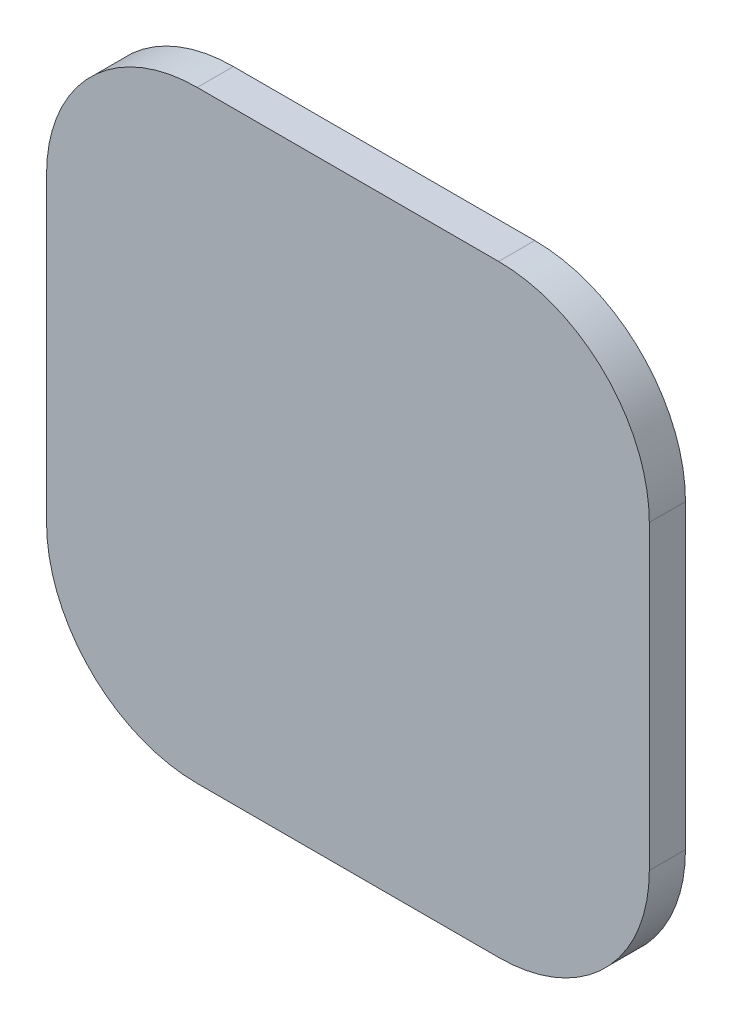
ISO-10303-21;
HEADER;
FILE_DESCRIPTION(('STEP AP214'),'2;1');
FILE_NAME('part.step','',(''),(''),'','','');
FILE_SCHEMA(('AUTOMOTIVE_DESIGN { 1 0 10303 214 1 1 1 1 }'));
ENDSEC;
DATA;
#1=APPLICATION_CONTEXT('core data for automotive mechanical design processes');
#2=APPLICATION_PROTOCOL_DEFINITION('international standard','automotive_design',2000,#1);
#3=PRODUCT_CONTEXT('',#1,'mechanical');
#4=PRODUCT('Part','Part','',(#3));
#5=PRODUCT_RELATED_PRODUCT_CATEGORY('part','',(#4));
#6=PRODUCT_DEFINITION_FORMATION('','',#4);
#7=PRODUCT_DEFINITION_CONTEXT('part definition',#1,'design');
#8=PRODUCT_DEFINITION('design','',#6,#7);
#9=PRODUCT_DEFINITION_SHAPE('','',#8);
#10=(LENGTH_UNIT() NAMED_UNIT(*) SI_UNIT(.MILLI.,.METRE.));
#11=(NAMED_UNIT(*) PLANE_ANGLE_UNIT() SI_UNIT($,.RADIAN.));
#12=(NAMED_UNIT(*) SI_UNIT($,.STERADIAN.) SOLID_ANGLE_UNIT());
#13=UNCERTAINTY_MEASURE_WITH_UNIT(LENGTH_MEASURE(1.E-05),#10,'distance_accuracy_value','');
#14=(GEOMETRIC_REPRESENTATION_CONTEXT(3) GLOBAL_UNCERTAINTY_ASSIGNED_CONTEXT((#13)) GLOBAL_UNIT_ASSIGNED_CONTEXT((#10,
#11,#12)) REPRESENTATION_CONTEXT('',''));
#15=CARTESIAN_POINT('',(0.,0.,0.));
#16=DIRECTION('',(0.,0.,1.));
#17=DIRECTION('',(1.,0.,0.));
#18=AXIS2_PLACEMENT_3D('',#15,#16,#17);
#19=CARTESIAN_POINT('',(-0.635,-0.635,0.));
#20=DIRECTION('',(0.,0.,1.));
#21=DIRECTION('',(1.,0.,0.));
#22=AXIS2_PLACEMENT_3D('',#19,#20,#21);
#23=PLANE('',#22);
#24=CARTESIAN_POINT('',(0.3175,-0.3175,0.));
#25=DIRECTION('',(0.,0.,1.));
#26=DIRECTION('',(1.,0.,0.));
#27=AXIS2_PLACEMENT_3D('',#24,#25,#26);
#28=CIRCLE('',#27,0.3175);
#29=CARTESIAN_POINT('',(0.31749975,-0.635,0.));
#30=VERTEX_POINT('',#29);
#31=CARTESIAN_POINT('',(0.635,-0.31749975,0.));
#32=VERTEX_POINT('',#31);
#33=EDGE_CURVE('E149',#30,#32,#28,.T.);
#34=ORIENTED_EDGE('',*,*,#33,.F.);
#35=CARTESIAN_POINT('',(-0.3175,-0.635,0.));
#36=CARTESIAN_POINT('',(0.3175,-0.635,0.));
#37=B_SPLINE_CURVE_WITH_KNOTS('',1,(#35,#36),.UNSPECIFIED.,.F.,.F.,(2,2),(0.,1.),.UNSPECIFIED.);
#38=CARTESIAN_POINT('',(-0.31749975,-0.635,0.));
#39=VERTEX_POINT('',#38);
#40=EDGE_CURVE('E107',#39,#30,#37,.T.);
#41=ORIENTED_EDGE('',*,*,#40,.F.);
#42=CARTESIAN_POINT('',(-0.3175,-0.3175,0.));
#43=DIRECTION('',(0.,0.,1.));
#44=DIRECTION('',(1.,0.,0.));
#45=AXIS2_PLACEMENT_3D('',#42,#43,#44);
#46=CIRCLE('',#45,0.3175);
#47=CARTESIAN_POINT('',(-0.635,-0.31749975,0.));
#48=VERTEX_POINT('',#47);
#49=EDGE_CURVE('E151',#48,#39,#46,.T.);
#50=ORIENTED_EDGE('',*,*,#49,.F.);
#51=CARTESIAN_POINT('',(-0.635,0.3175,0.));
#52=CARTESIAN_POINT('',(-0.635,-0.3175,0.));
#53=B_SPLINE_CURVE_WITH_KNOTS('',1,(#51,#52),.UNSPECIFIED.,.F.,.F.,(2,2),(0.,1.),.UNSPECIFIED.);
#54=CARTESIAN_POINT('',(-0.635,0.31749975,0.));
#55=VERTEX_POINT('',#54);
#56=EDGE_CURVE('E117',#55,#48,#53,.T.);
#57=ORIENTED_EDGE('',*,*,#56,.F.);
#58=CARTESIAN_POINT('',(-0.3175,0.3175,0.));
#59=DIRECTION('',(0.,0.,1.));
#60=DIRECTION('',(1.,0.,0.));
#61=AXIS2_PLACEMENT_3D('',#58,#59,#60);
#62=CIRCLE('',#61,0.3175);
#63=CARTESIAN_POINT('',(-0.31749975,0.635,0.));
#64=VERTEX_POINT('',#63);
#65=EDGE_CURVE('E153',#64,#55,#62,.T.);
#66=ORIENTED_EDGE('',*,*,#65,.F.);
#67=CARTESIAN_POINT('',(0.3175,0.635,0.));
#68=CARTESIAN_POINT('',(-0.3175,0.635,0.));
#69=B_SPLINE_CURVE_WITH_KNOTS('',1,(#67,#68),.UNSPECIFIED.,.F.,.F.,(2,2),(0.,1.),.UNSPECIFIED.);
#70=CARTESIAN_POINT('',(0.31749975,0.635,0.));
#71=VERTEX_POINT('',#70);
#72=EDGE_CURVE('E85',#71,#64,#69,.T.);
#73=ORIENTED_EDGE('',*,*,#72,.F.);
#74=CARTESIAN_POINT('',(0.3175,0.3175,0.));
#75=DIRECTION('',(0.,0.,1.));
#76=DIRECTION('',(1.,0.,0.));
#77=AXIS2_PLACEMENT_3D('',#74,#75,#76);
#78=CIRCLE('',#77,0.3175);
#79=CARTESIAN_POINT('',(0.635,0.3175,2.49999999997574E-07));
#80=VERTEX_POINT('',#79);
#81=EDGE_CURVE('E21',#80,#71,#78,.T.);
#82=ORIENTED_EDGE('',*,*,#81,.F.);
#83=CARTESIAN_POINT('',(0.635,-0.3175,0.));
#84=CARTESIAN_POINT('',(0.635,0.3175,0.));
#85=B_SPLINE_CURVE_WITH_KNOTS('',1,(#83,#84),.UNSPECIFIED.,.F.,.F.,(2,2),(0.,1.),.UNSPECIFIED.);
#86=EDGE_CURVE('E83',#32,#80,#85,.T.);
#87=ORIENTED_EDGE('',*,*,#86,.F.);
#88=EDGE_LOOP('',(#34,#41,#50,#57,#66,#73,#82,#87));
#89=FACE_BOUND('',#88,.T.);
#90=ADVANCED_FACE('F17',(#89),#23,.F.);
#91=CARTESIAN_POINT('',(0.635,0.3175,0.0762));
#92=CARTESIAN_POINT('',(0.635,0.3175,0.));
#93=B_SPLINE_CURVE_WITH_KNOTS('',1,(#91,#92),.UNSPECIFIED.,.F.,.F.,(2,2),(0.,1.),.UNSPECIFIED.);
#94=CARTESIAN_POINT('',(0.3175,0.3175,0.));
#95=DIRECTION('',(0.,0.,1.));
#96=AXIS1_PLACEMENT('',#94,#95);
#97=SURFACE_OF_REVOLUTION('',#93,#96);
#98=CARTESIAN_POINT('',(0.635,0.3175,0.0762));
#99=CARTESIAN_POINT('',(0.635,0.3175,0.));
#100=B_SPLINE_CURVE_WITH_KNOTS('',1,(#98,#99),.UNSPECIFIED.,.F.,.F.,(2,2),(0.,1.),.UNSPECIFIED.);
#101=CARTESIAN_POINT('',(0.635,0.3175,0.0762));
#102=VERTEX_POINT('',#101);
#103=EDGE_CURVE('E89',#80,#102,#100,.F.);
#104=ORIENTED_EDGE('',*,*,#103,.F.);
#105=ORIENTED_EDGE('',*,*,#81,.T.);
#106=CARTESIAN_POINT('',(0.3175,0.635,0.0762));
#107=CARTESIAN_POINT('',(0.3175,0.635,0.));
#108=B_SPLINE_CURVE_WITH_KNOTS('',1,(#106,#107),.UNSPECIFIED.,.F.,.F.,(2,2),(0.,1.),.UNSPECIFIED.);
#109=CARTESIAN_POINT('',(0.3175,0.635,0.0762));
#110=VERTEX_POINT('',#109);
#111=EDGE_CURVE('E133',#110,#71,#108,.T.);
#112=ORIENTED_EDGE('',*,*,#111,.F.);
#113=CARTESIAN_POINT('',(0.3175,0.3175,0.0762));
#114=DIRECTION('',(0.,0.,1.));
#115=DIRECTION('',(1.,0.,0.));
#116=AXIS2_PLACEMENT_3D('',#113,#114,#115);
#117=CIRCLE('',#116,0.3175);
#118=EDGE_CURVE('E92',#102,#110,#117,.T.);
#119=ORIENTED_EDGE('',*,*,#118,.F.);
#120=EDGE_LOOP('',(#104,#105,#112,#119));
#121=FACE_BOUND('',#120,.T.);
#122=ADVANCED_FACE('F90',(#121),#97,.F.);
#123=CARTESIAN_POINT('',(0.3175,0.635,0.0762));
#124=DIRECTION('',(0.,1.,0.));
#125=DIRECTION('',(0.,0.,-1.));
#126=AXIS2_PLACEMENT_3D('',#123,#124,#125);
#127=PLANE('',#126);
#128=ORIENTED_EDGE('',*,*,#111,.T.);
#129=ORIENTED_EDGE('',*,*,#72,.T.);
#130=CARTESIAN_POINT('',(-0.3175,0.635,0.0762));
#131=CARTESIAN_POINT('',(-0.3175,0.635,0.));
#132=B_SPLINE_CURVE_WITH_KNOTS('',1,(#130,#131),.UNSPECIFIED.,.F.,.F.,(2,2),(0.,1.),.UNSPECIFIED.);
#133=CARTESIAN_POINT('',(-0.3175,0.635,0.0762));
#134=VERTEX_POINT('',#133);
#135=EDGE_CURVE('E126',#134,#64,#132,.T.);
#136=ORIENTED_EDGE('',*,*,#135,.F.);
#137=DIRECTION('',(-1.,0.,0.));
#138=VECTOR('',#137,1.);
#139=CARTESIAN_POINT('',(0.,0.635,0.0762));
#140=LINE('',#139,#138);
#141=EDGE_CURVE('E147',#110,#134,#140,.T.);
#142=ORIENTED_EDGE('',*,*,#141,.F.);
#143=EDGE_LOOP('',(#128,#129,#136,#142));
#144=FACE_BOUND('',#143,.T.);
#145=ADVANCED_FACE('F188',(#144),#127,.T.);
#146=CARTESIAN_POINT('',(-0.3175,0.635,0.0762));
#147=CARTESIAN_POINT('',(-0.3175,0.635,0.));
#148=B_SPLINE_CURVE_WITH_KNOTS('',1,(#146,#147),.UNSPECIFIED.,.F.,.F.,(2,2),(0.,1.),.UNSPECIFIED.);
#149=CARTESIAN_POINT('',(-0.3175,0.3175,0.));
#150=DIRECTION('',(0.,0.,1.));
#151=AXIS1_PLACEMENT('',#149,#150);
#152=SURFACE_OF_REVOLUTION('',#148,#151);
#153=ORIENTED_EDGE('',*,*,#135,.T.);
#154=ORIENTED_EDGE('',*,*,#65,.T.);
#155=CARTESIAN_POINT('',(-0.635,0.3175,0.0762));
#156=CARTESIAN_POINT('',(-0.635,0.3175,0.));
#157=B_SPLINE_CURVE_WITH_KNOTS('',1,(#155,#156),.UNSPECIFIED.,.F.,.F.,(2,2),(0.,1.),.UNSPECIFIED.);
#158=CARTESIAN_POINT('',(-0.635,0.3175,0.0762));
#159=VERTEX_POINT('',#158);
#160=EDGE_CURVE('E125',#159,#55,#157,.T.);
#161=ORIENTED_EDGE('',*,*,#160,.F.);
#162=CARTESIAN_POINT('',(-0.3175,0.3175,0.0762));
#163=DIRECTION('',(0.,0.,1.));
#164=DIRECTION('',(1.,0.,0.));
#165=AXIS2_PLACEMENT_3D('',#162,#163,#164);
#166=CIRCLE('',#165,0.3175);
#167=EDGE_CURVE('E144',#134,#159,#166,.T.);
#168=ORIENTED_EDGE('',*,*,#167,.F.);
#169=EDGE_LOOP('',(#153,#154,#161,#168));
#170=FACE_BOUND('',#169,.T.);
#171=ADVANCED_FACE('F183',(#170),#152,.F.);
#172=CARTESIAN_POINT('',(-0.635,0.3175,0.0762));
#173=DIRECTION('',(-1.,0.,0.));
#174=DIRECTION('',(0.,0.,-1.));
#175=AXIS2_PLACEMENT_3D('',#172,#173,#174);
#176=PLANE('',#175);
#177=ORIENTED_EDGE('',*,*,#160,.T.);
#178=ORIENTED_EDGE('',*,*,#56,.T.);
#179=CARTESIAN_POINT('',(-0.635,-0.3175,0.0762));
#180=CARTESIAN_POINT('',(-0.635,-0.3175,0.));
#181=B_SPLINE_CURVE_WITH_KNOTS('',1,(#179,#180),.UNSPECIFIED.,.F.,.F.,(2,2),(0.,1.),.UNSPECIFIED.);
#182=CARTESIAN_POINT('',(-0.635,-0.3175,0.0762));
#183=VERTEX_POINT('',#182);
#184=EDGE_CURVE('E116',#183,#48,#181,.T.);
#185=ORIENTED_EDGE('',*,*,#184,.F.);
#186=DIRECTION('',(0.,-1.,0.));
#187=VECTOR('',#186,1.);
#188=CARTESIAN_POINT('',(-0.635,0.,0.0762));
#189=LINE('',#188,#187);
#190=EDGE_CURVE('E143',#159,#183,#189,.T.);
#191=ORIENTED_EDGE('',*,*,#190,.F.);
#192=EDGE_LOOP('',(#177,#178,#185,#191));
#193=FACE_BOUND('',#192,.T.);
#194=ADVANCED_FACE('F187',(#193),#176,.T.);
#195=CARTESIAN_POINT('',(-0.635,-0.3175,0.0762));
#196=CARTESIAN_POINT('',(-0.635,-0.3175,0.));
#197=B_SPLINE_CURVE_WITH_KNOTS('',1,(#195,#196),.UNSPECIFIED.,.F.,.F.,(2,2),(0.,1.),.UNSPECIFIED.);
#198=CARTESIAN_POINT('',(-0.3175,-0.3175,0.));
#199=DIRECTION('',(0.,0.,1.));
#200=AXIS1_PLACEMENT('',#198,#199);
#201=SURFACE_OF_REVOLUTION('',#197,#200);
#202=ORIENTED_EDGE('',*,*,#184,.T.);
#203=ORIENTED_EDGE('',*,*,#49,.T.);
#204=CARTESIAN_POINT('',(-0.3175,-0.635,0.0762));
#205=CARTESIAN_POINT('',(-0.3175,-0.635,0.));
#206=B_SPLINE_CURVE_WITH_KNOTS('',1,(#204,#205),.UNSPECIFIED.,.F.,.F.,(2,2),(0.,1.),.UNSPECIFIED.);
#207=CARTESIAN_POINT('',(-0.3175,-0.635,0.0762));
#208=VERTEX_POINT('',#207);
#209=EDGE_CURVE('E115',#208,#39,#206,.T.);
#210=ORIENTED_EDGE('',*,*,#209,.F.);
#211=CARTESIAN_POINT('',(-0.3175,-0.3175,0.0762));
#212=DIRECTION('',(0.,0.,1.));
#213=DIRECTION('',(1.,0.,0.));
#214=AXIS2_PLACEMENT_3D('',#211,#212,#213);
#215=CIRCLE('',#214,0.3175);
#216=EDGE_CURVE('E140',#183,#208,#215,.T.);
#217=ORIENTED_EDGE('',*,*,#216,.F.);
#218=EDGE_LOOP('',(#202,#203,#210,#217));
#219=FACE_BOUND('',#218,.T.);
#220=ADVANCED_FACE('F189',(#219),#201,.F.);
#221=CARTESIAN_POINT('',(-0.3175,-0.635,0.0762));
#222=DIRECTION('',(0.,-1.,0.));
#223=DIRECTION('',(0.,0.,-1.));
#224=AXIS2_PLACEMENT_3D('',#221,#222,#223);
#225=PLANE('',#224);
#226=ORIENTED_EDGE('',*,*,#209,.T.);
#227=ORIENTED_EDGE('',*,*,#40,.T.);
#228=CARTESIAN_POINT('',(0.3175,-0.635,0.0762));
#229=CARTESIAN_POINT('',(0.3175,-0.635,0.));
#230=B_SPLINE_CURVE_WITH_KNOTS('',1,(#228,#229),.UNSPECIFIED.,.F.,.F.,(2,2),(0.,1.),.UNSPECIFIED.);
#231=CARTESIAN_POINT('',(0.3175,-0.635,0.0762));
#232=VERTEX_POINT('',#231);
#233=EDGE_CURVE('E94',#232,#30,#230,.T.);
#234=ORIENTED_EDGE('',*,*,#233,.F.);
#235=DIRECTION('',(1.,0.,0.));
#236=VECTOR('',#235,1.);
#237=CARTESIAN_POINT('',(0.,-0.635,0.0762));
#238=LINE('',#237,#236);
#239=EDGE_CURVE('E139',#208,#232,#238,.T.);
#240=ORIENTED_EDGE('',*,*,#239,.F.);
#241=EDGE_LOOP('',(#226,#227,#234,#240));
#242=FACE_BOUND('',#241,.T.);
#243=ADVANCED_FACE('F201',(#242),#225,.T.);
#244=CARTESIAN_POINT('',(0.3175,-0.635,0.0762));
#245=CARTESIAN_POINT('',(0.3175,-0.635,0.));
#246=B_SPLINE_CURVE_WITH_KNOTS('',1,(#244,#245),.UNSPECIFIED.,.F.,.F.,(2,2),(0.,1.),.UNSPECIFIED.);
#247=CARTESIAN_POINT('',(0.3175,-0.3175,0.));
#248=DIRECTION('',(0.,0.,1.));
#249=AXIS1_PLACEMENT('',#247,#248);
#250=SURFACE_OF_REVOLUTION('',#246,#249);
#251=ORIENTED_EDGE('',*,*,#233,.T.);
#252=ORIENTED_EDGE('',*,*,#33,.T.);
#253=CARTESIAN_POINT('',(0.635,-0.3175,0.0762));
#254=CARTESIAN_POINT('',(0.635,-0.3175,0.));
#255=B_SPLINE_CURVE_WITH_KNOTS('',1,(#253,#254),.UNSPECIFIED.,.F.,.F.,(2,2),(0.,1.),.UNSPECIFIED.);
#256=CARTESIAN_POINT('',(0.635,-0.3175,0.0762));
#257=VERTEX_POINT('',#256);
#258=EDGE_CURVE('E36',#257,#32,#255,.T.);
#259=ORIENTED_EDGE('',*,*,#258,.F.);
#260=CARTESIAN_POINT('',(0.3175,-0.3175,0.0762));
#261=DIRECTION('',(0.,0.,1.));
#262=DIRECTION('',(1.,0.,0.));
#263=AXIS2_PLACEMENT_3D('',#260,#261,#262);
#264=CIRCLE('',#263,0.3175);
#265=EDGE_CURVE('E27',#232,#257,#264,.T.);
#266=ORIENTED_EDGE('',*,*,#265,.F.);
#267=EDGE_LOOP('',(#251,#252,#259,#266));
#268=FACE_BOUND('',#267,.T.);
#269=ADVANCED_FACE('F203',(#268),#250,.F.);
#270=CARTESIAN_POINT('',(0.635,-0.3175,0.0762));
#271=DIRECTION('',(1.,0.,0.));
#272=DIRECTION('',(0.,0.,-1.));
#273=AXIS2_PLACEMENT_3D('',#270,#271,#272);
#274=PLANE('',#273);
#275=ORIENTED_EDGE('',*,*,#258,.T.);
#276=ORIENTED_EDGE('',*,*,#86,.T.);
#277=ORIENTED_EDGE('',*,*,#103,.T.);
#278=DIRECTION('',(0.,1.,0.));
#279=VECTOR('',#278,1.);
#280=CARTESIAN_POINT('',(0.635,0.,0.0762));
#281=LINE('',#280,#279);
#282=EDGE_CURVE('E11',#257,#102,#281,.T.);
#283=ORIENTED_EDGE('',*,*,#282,.F.);
#284=EDGE_LOOP('',(#275,#276,#277,#283));
#285=FACE_BOUND('',#284,.T.);
#286=ADVANCED_FACE('F96',(#285),#274,.T.);
#287=CARTESIAN_POINT('',(-0.635,-0.635,0.0762));
#288=DIRECTION('',(0.,0.,1.));
#289=DIRECTION('',(1.,0.,0.));
#290=AXIS2_PLACEMENT_3D('',#287,#288,#289);
#291=PLANE('',#290);
#292=ORIENTED_EDGE('',*,*,#265,.T.);
#293=ORIENTED_EDGE('',*,*,#282,.T.);
#294=ORIENTED_EDGE('',*,*,#118,.T.);
#295=ORIENTED_EDGE('',*,*,#141,.T.);
#296=ORIENTED_EDGE('',*,*,#167,.T.);
#297=ORIENTED_EDGE('',*,*,#190,.T.);
#298=ORIENTED_EDGE('',*,*,#216,.T.);
#299=ORIENTED_EDGE('',*,*,#239,.T.);
#300=EDGE_LOOP('',(#292,#293,#294,#295,#296,#297,#298,#299));
#301=FACE_BOUND('',#300,.T.);
#302=ADVANCED_FACE('F19',(#301),#291,.T.);
#303=CLOSED_SHELL('',(#90,#122,#145,#171,#194,#220,#243,#269,#286,#302));
#304=MANIFOLD_SOLID_BREP('B1',#303);
#305=ADVANCED_BREP_SHAPE_REPRESENTATION('',(#18,#304),#14);
#306=SHAPE_DEFINITION_REPRESENTATION(#9,#305);
ENDSEC;
END-ISO-10303-21;
